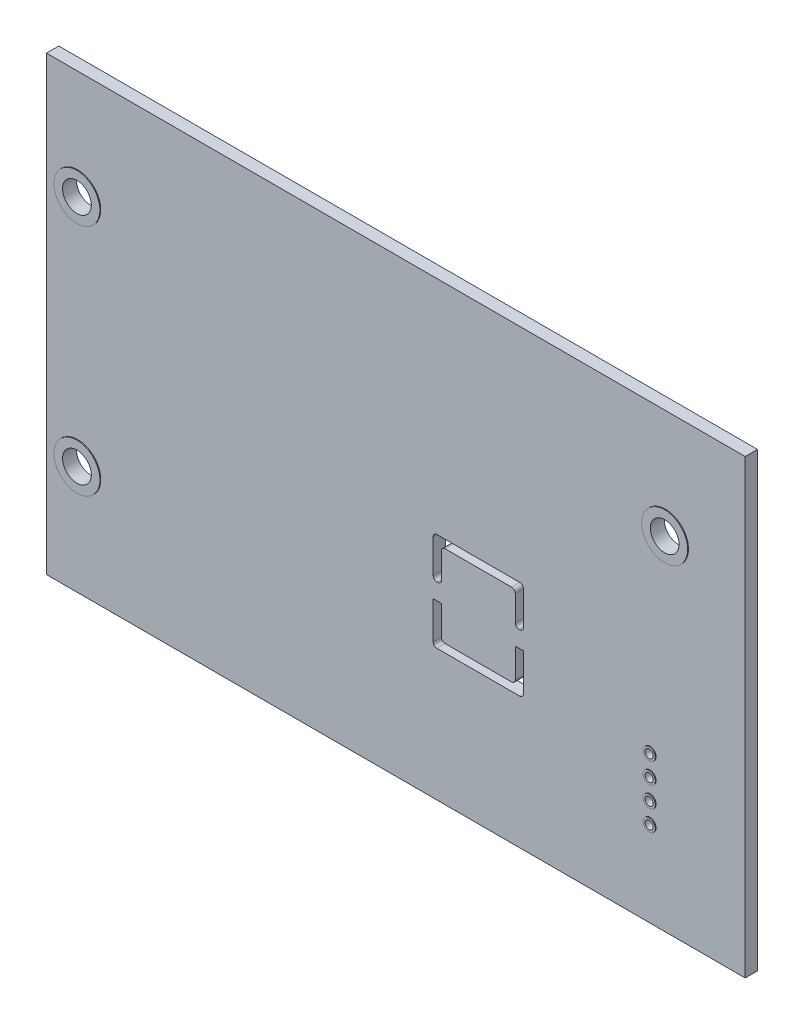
from build123d import *

# Parameters (mm, degrees)
SKETCH_1_W           = 85.1
SKETCH_1_H           = 55
SKETCH_1_R           = 1.75
EXTRUDE_1_DEPTH      = 1.5
EXTRUDE_2_DEPTH      = 0.1
EXTRUDE_2_DEPTH_BACK = 1.6
SKETCH_2_R           = 2.8
SKETCH_2_R_2         = 1.75
SKETCH_3_R           = 0.5
CUT_EXTRUDE_1_DEPTH  = 51.688386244
EXTRUDE_3_DEPTH      = 0.1
EXTRUDE_3_DEPTH_BACK = 1.6
SKETCH_4_R           = 0.75
SKETCH_4_R_2         = 0.5
CUT_EXTRUDE_2_REACH  = 52.688


with BuildPart() as part:
    # Sketch 1 → Extrude 1 (new body)
    with BuildSketch(Plane.XY):
        Rectangle(SKETCH_1_W, SKETCH_1_H)
        with Locations((-38.74, 14.29)):
            Circle(SKETCH_1_R, mode=Mode.SUBTRACT)
        with Locations((32.84, 14.29)):
            Circle(SKETCH_1_R, mode=Mode.SUBTRACT)
        with Locations((-38.74, -14.16)):
            Circle(SKETCH_1_R, mode=Mode.SUBTRACT)
    extrude(amount=EXTRUDE_1_DEPTH)

    # Sketch 2 → Extrude 2 (add, two sides: drawn at the far end of the back side and taken through both)
    # profile 1 of 3: a face of its own
    with BuildSketch(Plane.XY.offset(1.5).offset(-EXTRUDE_2_DEPTH_BACK)):
        with Locations((-38.74, 14.29)):
            Circle(SKETCH_2_R)
        with Locations((-38.74, 14.29)):
            Circle(SKETCH_2_R_2, mode=Mode.SUBTRACT)
    # profile 2 of 3: a face of its own
    with BuildSketch(Plane.XY.offset(1.5).offset(-EXTRUDE_2_DEPTH_BACK)):
        with Locations((-38.74, -14.16)):
            Circle(SKETCH_2_R)
        with Locations((-38.74, -14.16)):
            Circle(SKETCH_2_R_2, mode=Mode.SUBTRACT)
    # profile 3 of 3: a face of its own
    with BuildSketch(Plane.XY.offset(1.5).offset(-EXTRUDE_2_DEPTH_BACK)):
        with Locations((32.84, 14.29)):
            Circle(SKETCH_2_R)
        with Locations((32.84, 14.29)):
            Circle(SKETCH_2_R_2, mode=Mode.SUBTRACT)
    extrude(amount=EXTRUDE_2_DEPTH + EXTRUDE_2_DEPTH_BACK)

    # Sketch 3 → Cut-Extrude 1 (cut, through all)
    with BuildSketch(Plane(origin=(0, 0, 0), x_dir=(-1, 0, 0), z_dir=(0, 0, -1))):
        with Locations((-30.95, -17.1)):
            Circle(SKETCH_3_R)
        with Locations((-30.95, -14.6)):
            Circle(SKETCH_3_R)
        with Locations((-30.95, -12.1)):
            Circle(SKETCH_3_R)
        with Locations((-30.95, -9.6)):
            Circle(SKETCH_3_R)
    extrude(amount=-CUT_EXTRUDE_1_DEPTH, mode=Mode.SUBTRACT)

    # Sketch 4 → Extrude 3 (add, two sides: drawn at the far end of the back side and taken through both)
    # profile 1 of 4: a face of its own
    with BuildSketch(Plane(origin=(0, 0, 0), x_dir=(-1, 0, 0), z_dir=(0, 0, -1)).offset(-EXTRUDE_3_DEPTH_BACK)):
        with Locations((-30.95, -17.1)):
            Circle(SKETCH_4_R)
        with Locations((-30.95, -17.1)):
            Circle(SKETCH_4_R_2, mode=Mode.SUBTRACT)
    # profile 2 of 4: a face of its own
    with BuildSketch(Plane(origin=(0, 0, 0), x_dir=(-1, 0, 0), z_dir=(0, 0, -1)).offset(-EXTRUDE_3_DEPTH_BACK)):
        with Locations((-30.95, -14.6)):
            Circle(SKETCH_4_R)
        with Locations((-30.95, -14.6)):
            Circle(SKETCH_4_R_2, mode=Mode.SUBTRACT)
    # profile 3 of 4: a face of its own
    with BuildSketch(Plane(origin=(0, 0, 0), x_dir=(-1, 0, 0), z_dir=(0, 0, -1)).offset(-EXTRUDE_3_DEPTH_BACK)):
        with Locations((-30.95, -12.1)):
            Circle(SKETCH_4_R)
        with Locations((-30.95, -12.1)):
            Circle(SKETCH_4_R_2, mode=Mode.SUBTRACT)
    # profile 4 of 4: a face of its own
    with BuildSketch(Plane(origin=(0, 0, 0), x_dir=(-1, 0, 0), z_dir=(0, 0, -1)).offset(-EXTRUDE_3_DEPTH_BACK)):
        with Locations((-30.95, -9.6)):
            Circle(SKETCH_4_R)
        with Locations((-30.95, -9.6)):
            Circle(SKETCH_4_R_2, mode=Mode.SUBTRACT)
    extrude(amount=EXTRUDE_3_DEPTH + EXTRUDE_3_DEPTH_BACK)

    # Sketch 5 → Cut-Extrude 2 (cut, up to next)
    with BuildSketch(Plane(origin=(0, 0, 0), x_dir=(-1, 0, 0), z_dir=(0, 0, -1)), mode=Mode.PRIVATE) as cut_extrude_2_sk1:
        with BuildLine():
            Line((-15.55, -4.05), (-15.55, 0.05))
            ThreePointArc((-15.55, 0.05), (-15.418198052, 0.368198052), (-15.1, 0.5))
            Line((-15.1, 0.5), (-5, 0.5))
            ThreePointArc((-5, 0.5), (-4.681801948, 0.368198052), (-4.55, 0.05))
            Line((-4.55, 0.05), (-4.55, -4.05))
            ThreePointArc((-4.55, -4.05), (-4.681801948, -4.368198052), (-5, -4.5))
            Line((-5, -4.5), (-5.1, -4.5))
            ThreePointArc((-5.1, -4.5), (-5.418198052, -4.368198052), (-5.55, -4.05))
            Line((-5.55, -4.05), (-5.55, -0.95))
            ThreePointArc((-5.55, -0.95), (-5.681801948, -0.631801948), (-6, -0.5))
            Line((-6, -0.5), (-14.1, -0.5))
            ThreePointArc((-14.1, -0.5), (-14.418198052, -0.631801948), (-14.55, -0.95))
            Line((-14.55, -0.95), (-14.55, -4.05))
            ThreePointArc((-14.55, -4.05), (-14.681801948, -4.368198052), (-15, -4.5))
            Line((-15, -4.5), (-15.1, -4.5))
            ThreePointArc((-15.1, -4.5), (-15.418198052, -4.368198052), (-15.55, -4.05))
        make_face()
    cut_extrude_2_tool1 = extrude(cut_extrude_2_sk1.sketch, amount=-CUT_EXTRUDE_2_REACH, mode=Mode.PRIVATE) & part.part
    # Sketch 5 → Cut-Extrude 2 (cut, up to next)
    with BuildSketch(Plane(origin=(0, 0, 0), x_dir=(-1, 0, 0), z_dir=(0, 0, -1)), mode=Mode.PRIVATE) as cut_extrude_2_sk2:
        with BuildLine():
            Line((-14.55, -6.5), (-15.55, -6.5))
            Line((-15.55, -6.5), (-15.55, -11.05))
            ThreePointArc((-15.55, -11.05), (-15.418198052, -11.368198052), (-15.1, -11.5))
            Line((-15.1, -11.5), (-5, -11.5))
            ThreePointArc((-5, -11.5), (-4.681801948, -11.368198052), (-4.55, -11.05))
            Line((-4.55, -11.05), (-4.55, -6.5))
            Line((-4.55, -6.5), (-5.55, -6.5))
            Line((-5.55, -6.5), (-5.55, -10.05))
            ThreePointArc((-5.55, -10.05), (-5.681801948, -10.368198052), (-6, -10.5))
            Line((-6, -10.5), (-14.1, -10.5))
            ThreePointArc((-14.1, -10.5), (-14.418198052, -10.368198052), (-14.55, -10.05))
            Line((-14.55, -10.05), (-14.55, -6.5))
        make_face()
    cut_extrude_2_tool2 = extrude(cut_extrude_2_sk2.sketch, amount=-CUT_EXTRUDE_2_REACH, mode=Mode.PRIVATE) & part.part
    add(cut_extrude_2_tool1.solids().sort_by_distance((15.332758, -4.282758, 0))[0], mode=Mode.SUBTRACT)
    add(cut_extrude_2_tool2.solids().sort_by_distance((5.42917, -8.275, 0))[0], mode=Mode.SUBTRACT)


solid = part.part
